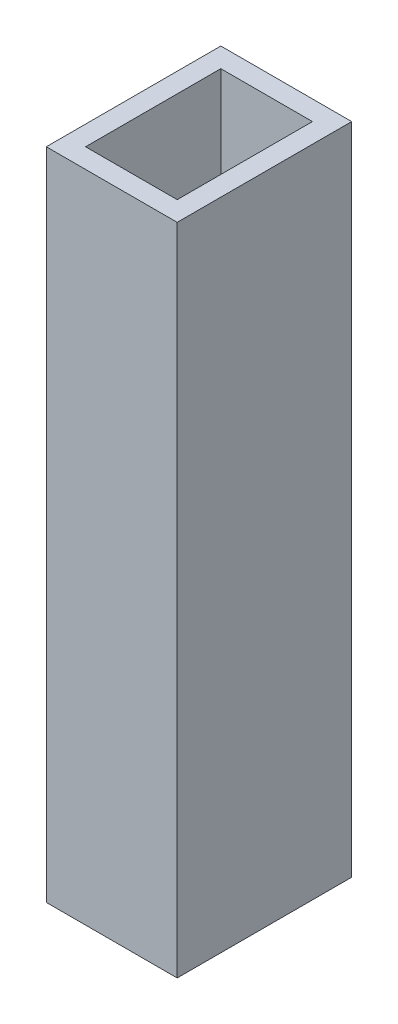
from build123d import *

# Parameters (mm, degrees)
SKETCH2_W          = 76.2
SKETCH2_H          = 101.6
EXTRUDE1_DEPTH     = 381
SKETCH8_W          = 53.34
SKETCH8_H          = 78.74
CUT_EXTRUDE2_DEPTH = 134.62


with BuildPart() as part:
    # Sketch2 → Extrude1 (new body)
    with BuildSketch(Plane(origin=(0, 0, 0), x_dir=(1, 0, 0), z_dir=(0, 1, 0))):
        with Locations((-38.1, 50.8)):
            Rectangle(SKETCH2_W, SKETCH2_H)
    extrude(amount=EXTRUDE1_DEPTH)

    # Sketch8 → Cut-Extrude2 (cut)
    with BuildSketch(Plane(origin=(0, 381, 0), x_dir=(-1, 0, 0), z_dir=(0, 1, 0))):
        with Locations((38.1, -50.8)):
            Rectangle(SKETCH8_W, SKETCH8_H)
    extrude(amount=-CUT_EXTRUDE2_DEPTH, mode=Mode.SUBTRACT)


solid = part.part
